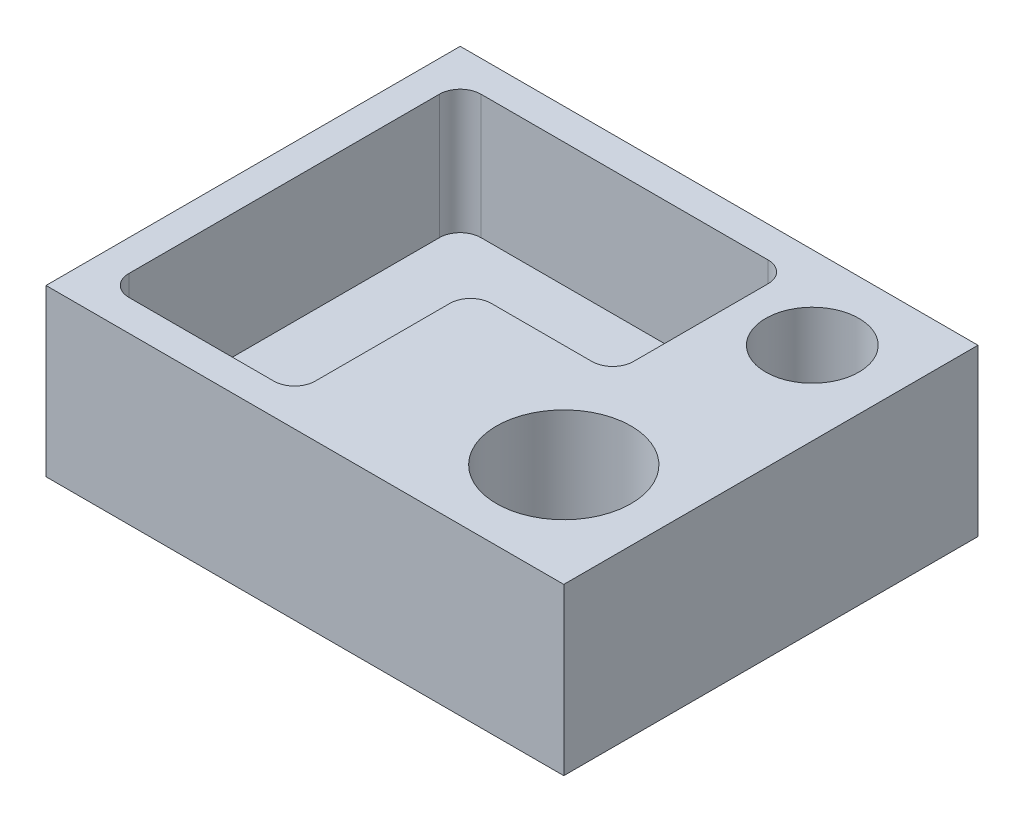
ISO-10303-21;
HEADER;
FILE_DESCRIPTION(('STEP AP214'),'2;1');
FILE_NAME('part.step','',(''),(''),'','','');
FILE_SCHEMA(('AUTOMOTIVE_DESIGN { 1 0 10303 214 1 1 1 1 }'));
ENDSEC;
DATA;
#1=APPLICATION_CONTEXT('core data for automotive mechanical design processes');
#2=APPLICATION_PROTOCOL_DEFINITION('international standard','automotive_design',2000,#1);
#3=PRODUCT_CONTEXT('',#1,'mechanical');
#4=PRODUCT('Part','Part','',(#3));
#5=PRODUCT_RELATED_PRODUCT_CATEGORY('part','',(#4));
#6=PRODUCT_DEFINITION_FORMATION('','',#4);
#7=PRODUCT_DEFINITION_CONTEXT('part definition',#1,'design');
#8=PRODUCT_DEFINITION('design','',#6,#7);
#9=PRODUCT_DEFINITION_SHAPE('','',#8);
#10=(LENGTH_UNIT() NAMED_UNIT(*) SI_UNIT(.MILLI.,.METRE.));
#11=(NAMED_UNIT(*) PLANE_ANGLE_UNIT() SI_UNIT($,.RADIAN.));
#12=(NAMED_UNIT(*) SI_UNIT($,.STERADIAN.) SOLID_ANGLE_UNIT());
#13=UNCERTAINTY_MEASURE_WITH_UNIT(LENGTH_MEASURE(1.E-05),#10,'distance_accuracy_value','');
#14=(GEOMETRIC_REPRESENTATION_CONTEXT(3) GLOBAL_UNCERTAINTY_ASSIGNED_CONTEXT((#13)) GLOBAL_UNIT_ASSIGNED_CONTEXT((#10,
#11,#12)) REPRESENTATION_CONTEXT('',''));
#15=CARTESIAN_POINT('',(0.,0.,0.));
#16=DIRECTION('',(0.,0.,1.));
#17=DIRECTION('',(1.,0.,0.));
#18=AXIS2_PLACEMENT_3D('',#15,#16,#17);
#19=CARTESIAN_POINT('',(-125.,80.,100.));
#20=DIRECTION('',(1.,0.,0.));
#21=DIRECTION('',(0.,0.,-1.));
#22=AXIS2_PLACEMENT_3D('',#19,#20,#21);
#23=PLANE('',#22);
#24=DIRECTION('',(0.,0.,1.));
#25=VECTOR('',#24,1.);
#26=CARTESIAN_POINT('',(-125.,0.,100.));
#27=LINE('',#26,#25);
#28=CARTESIAN_POINT('',(-125.,0.,-100.));
#29=VERTEX_POINT('',#28);
#30=CARTESIAN_POINT('',(-125.,0.,100.));
#31=VERTEX_POINT('',#30);
#32=EDGE_CURVE('E184',#29,#31,#27,.T.);
#33=ORIENTED_EDGE('',*,*,#32,.T.);
#34=DIRECTION('',(0.,-1.,0.));
#35=VECTOR('',#34,1.);
#36=CARTESIAN_POINT('',(-125.,80.,100.));
#37=LINE('',#36,#35);
#38=CARTESIAN_POINT('',(-125.,80.,100.));
#39=VERTEX_POINT('',#38);
#40=EDGE_CURVE('E165',#39,#31,#37,.T.);
#41=ORIENTED_EDGE('',*,*,#40,.F.);
#42=DIRECTION('',(0.,0.,1.));
#43=VECTOR('',#42,1.);
#44=CARTESIAN_POINT('',(-125.,80.,100.));
#45=LINE('',#44,#43);
#46=CARTESIAN_POINT('',(-125.,80.,-100.));
#47=VERTEX_POINT('',#46);
#48=EDGE_CURVE('E172',#47,#39,#45,.T.);
#49=ORIENTED_EDGE('',*,*,#48,.F.);
#50=DIRECTION('',(0.,-1.,0.));
#51=VECTOR('',#50,1.);
#52=CARTESIAN_POINT('',(-125.,80.,-100.));
#53=LINE('',#52,#51);
#54=EDGE_CURVE('E299',#47,#29,#53,.T.);
#55=ORIENTED_EDGE('',*,*,#54,.T.);
#56=EDGE_LOOP('',(#33,#41,#49,#55));
#57=FACE_BOUND('',#56,.T.);
#58=ADVANCED_FACE('F46',(#57),#23,.F.);
#59=CARTESIAN_POINT('',(125.,80.,100.));
#60=DIRECTION('',(0.,0.,-1.));
#61=DIRECTION('',(-1.,0.,0.));
#62=AXIS2_PLACEMENT_3D('',#59,#60,#61);
#63=PLANE('',#62);
#64=DIRECTION('',(1.,0.,0.));
#65=VECTOR('',#64,1.);
#66=CARTESIAN_POINT('',(125.,0.,100.));
#67=LINE('',#66,#65);
#68=CARTESIAN_POINT('',(125.,0.,100.));
#69=VERTEX_POINT('',#68);
#70=EDGE_CURVE('E301',#31,#69,#67,.T.);
#71=ORIENTED_EDGE('',*,*,#70,.T.);
#72=DIRECTION('',(0.,-1.,0.));
#73=VECTOR('',#72,1.);
#74=CARTESIAN_POINT('',(125.,80.,100.));
#75=LINE('',#74,#73);
#76=CARTESIAN_POINT('',(125.,80.,100.));
#77=VERTEX_POINT('',#76);
#78=EDGE_CURVE('E168',#77,#69,#75,.T.);
#79=ORIENTED_EDGE('',*,*,#78,.F.);
#80=DIRECTION('',(1.,0.,0.));
#81=VECTOR('',#80,1.);
#82=CARTESIAN_POINT('',(125.,80.,100.));
#83=LINE('',#82,#81);
#84=EDGE_CURVE('E161',#39,#77,#83,.T.);
#85=ORIENTED_EDGE('',*,*,#84,.F.);
#86=ORIENTED_EDGE('',*,*,#40,.T.);
#87=EDGE_LOOP('',(#71,#79,#85,#86));
#88=FACE_BOUND('',#87,.T.);
#89=ADVANCED_FACE('F163',(#88),#63,.F.);
#90=CARTESIAN_POINT('',(125.,80.,100.));
#91=DIRECTION('',(-1.,0.,0.));
#92=DIRECTION('',(0.,0.,1.));
#93=AXIS2_PLACEMENT_3D('',#90,#91,#92);
#94=PLANE('',#93);
#95=DIRECTION('',(0.,0.,-1.));
#96=VECTOR('',#95,1.);
#97=CARTESIAN_POINT('',(125.,0.,100.));
#98=LINE('',#97,#96);
#99=CARTESIAN_POINT('',(125.,0.,-100.));
#100=VERTEX_POINT('',#99);
#101=EDGE_CURVE('E303',#69,#100,#98,.T.);
#102=ORIENTED_EDGE('',*,*,#101,.T.);
#103=DIRECTION('',(0.,-1.,0.));
#104=VECTOR('',#103,1.);
#105=CARTESIAN_POINT('',(125.,80.,-100.));
#106=LINE('',#105,#104);
#107=CARTESIAN_POINT('',(125.,80.,-100.));
#108=VERTEX_POINT('',#107);
#109=EDGE_CURVE('E190',#108,#100,#106,.T.);
#110=ORIENTED_EDGE('',*,*,#109,.F.);
#111=DIRECTION('',(0.,0.,-1.));
#112=VECTOR('',#111,1.);
#113=CARTESIAN_POINT('',(125.,80.,100.));
#114=LINE('',#113,#112);
#115=EDGE_CURVE('E171',#77,#108,#114,.T.);
#116=ORIENTED_EDGE('',*,*,#115,.F.);
#117=ORIENTED_EDGE('',*,*,#78,.T.);
#118=EDGE_LOOP('',(#102,#110,#116,#117));
#119=FACE_BOUND('',#118,.T.);
#120=ADVANCED_FACE('F315',(#119),#94,.F.);
#121=CARTESIAN_POINT('',(125.,80.,-100.));
#122=DIRECTION('',(0.,0.,1.));
#123=DIRECTION('',(1.,0.,0.));
#124=AXIS2_PLACEMENT_3D('',#121,#122,#123);
#125=PLANE('',#124);
#126=DIRECTION('',(-1.,0.,0.));
#127=VECTOR('',#126,1.);
#128=CARTESIAN_POINT('',(125.,0.,-100.));
#129=LINE('',#128,#127);
#130=EDGE_CURVE('E181',#100,#29,#129,.T.);
#131=ORIENTED_EDGE('',*,*,#130,.T.);
#132=ORIENTED_EDGE('',*,*,#54,.F.);
#133=DIRECTION('',(-1.,0.,0.));
#134=VECTOR('',#133,1.);
#135=CARTESIAN_POINT('',(125.,80.,-100.));
#136=LINE('',#135,#134);
#137=EDGE_CURVE('E177',#108,#47,#136,.T.);
#138=ORIENTED_EDGE('',*,*,#137,.F.);
#139=ORIENTED_EDGE('',*,*,#109,.T.);
#140=EDGE_LOOP('',(#131,#132,#138,#139));
#141=FACE_BOUND('',#140,.T.);
#142=ADVANCED_FACE('F310',(#141),#125,.F.);
#143=CARTESIAN_POINT('',(0.,80.,0.));
#144=DIRECTION('',(0.,1.,0.));
#145=DIRECTION('',(0.,0.,1.));
#146=AXIS2_PLACEMENT_3D('',#143,#144,#145);
#147=PLANE('',#146);
#148=CARTESIAN_POINT('',(75.,80.,50.));
#149=DIRECTION('',(0.,1.,0.));
#150=DIRECTION('',(0.,0.,-1.));
#151=AXIS2_PLACEMENT_3D('',#148,#149,#150);
#152=CIRCLE('',#151,32.5);
#153=CARTESIAN_POINT('',(75.,80.,17.5));
#154=VERTEX_POINT('',#153);
#155=EDGE_CURVE('E594',#154,#154,#152,.T.);
#156=ORIENTED_EDGE('',*,*,#155,.F.);
#157=EDGE_LOOP('',(#156));
#158=FACE_BOUND('',#157,.T.);
#159=CARTESIAN_POINT('',(85.,80.,-60.));
#160=DIRECTION('',(0.,1.,0.));
#161=DIRECTION('',(0.,0.,1.));
#162=AXIS2_PLACEMENT_3D('',#159,#160,#161);
#163=CIRCLE('',#162,22.5);
#164=CARTESIAN_POINT('',(85.,80.,-37.5));
#165=VERTEX_POINT('',#164);
#166=EDGE_CURVE('E589',#165,#165,#163,.T.);
#167=ORIENTED_EDGE('',*,*,#166,.F.);
#168=EDGE_LOOP('',(#167));
#169=FACE_BOUND('',#168,.T.);
#170=DIRECTION('',(1.,0.,0.));
#171=VECTOR('',#170,1.);
#172=CARTESIAN_POINT('',(48.6206560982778,80.,0.));
#173=LINE('',#172,#171);
#174=CARTESIAN_POINT('',(-9.99999999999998,80.,0.));
#175=VERTEX_POINT('',#174);
#176=CARTESIAN_POINT('',(38.6206560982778,80.,0.));
#177=VERTEX_POINT('',#176);
#178=EDGE_CURVE('E289',#175,#177,#173,.T.);
#179=ORIENTED_EDGE('',*,*,#178,.F.);
#180=CARTESIAN_POINT('',(-9.99999999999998,80.,10.));
#181=DIRECTION('',(0.,1.,0.));
#182=DIRECTION('',(0.,0.,1.));
#183=AXIS2_PLACEMENT_3D('',#180,#181,#182);
#184=CIRCLE('',#183,10.);
#185=CARTESIAN_POINT('',(-20.,80.,10.));
#186=VERTEX_POINT('',#185);
#187=EDGE_CURVE('E196',#175,#186,#184,.T.);
#188=ORIENTED_EDGE('',*,*,#187,.T.);
#189=DIRECTION('',(0.,0.,-1.));
#190=VECTOR('',#189,1.);
#191=CARTESIAN_POINT('',(-20.,80.,0.));
#192=LINE('',#191,#190);
#193=CARTESIAN_POINT('',(-20.,80.,75.0000000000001));
#194=VERTEX_POINT('',#193);
#195=EDGE_CURVE('E286',#194,#186,#192,.T.);
#196=ORIENTED_EDGE('',*,*,#195,.F.);
#197=CARTESIAN_POINT('',(-30.,80.,75.0000000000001));
#198=DIRECTION('',(0.,1.,0.));
#199=DIRECTION('',(0.,0.,1.));
#200=AXIS2_PLACEMENT_3D('',#197,#198,#199);
#201=CIRCLE('',#200,10.);
#202=CARTESIAN_POINT('',(-30.,80.,85.));
#203=VERTEX_POINT('',#202);
#204=EDGE_CURVE('E239',#194,#203,#201,.F.);
#205=ORIENTED_EDGE('',*,*,#204,.T.);
#206=DIRECTION('',(1.,0.,0.));
#207=VECTOR('',#206,1.);
#208=CARTESIAN_POINT('',(-20.,80.,85.));
#209=LINE('',#208,#207);
#210=CARTESIAN_POINT('',(-100.,80.,85.));
#211=VERTEX_POINT('',#210);
#212=EDGE_CURVE('E247',#211,#203,#209,.T.);
#213=ORIENTED_EDGE('',*,*,#212,.F.);
#214=CARTESIAN_POINT('',(-100.,80.,75.0000000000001));
#215=DIRECTION('',(0.,1.,0.));
#216=DIRECTION('',(0.,0.,1.));
#217=AXIS2_PLACEMENT_3D('',#214,#215,#216);
#218=CIRCLE('',#217,10.);
#219=CARTESIAN_POINT('',(-110.,80.,75.0000000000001));
#220=VERTEX_POINT('',#219);
#221=EDGE_CURVE('E54',#211,#220,#218,.F.);
#222=ORIENTED_EDGE('',*,*,#221,.T.);
#223=DIRECTION('',(0.,0.,1.));
#224=VECTOR('',#223,1.);
#225=CARTESIAN_POINT('',(-110.,80.,-85.));
#226=LINE('',#225,#224);
#227=CARTESIAN_POINT('',(-110.,80.,-75.));
#228=VERTEX_POINT('',#227);
#229=EDGE_CURVE('E245',#228,#220,#226,.T.);
#230=ORIENTED_EDGE('',*,*,#229,.F.);
#231=CARTESIAN_POINT('',(-100.,80.,-75.));
#232=DIRECTION('',(0.,1.,0.));
#233=DIRECTION('',(0.,0.,1.));
#234=AXIS2_PLACEMENT_3D('',#231,#232,#233);
#235=CIRCLE('',#234,10.);
#236=CARTESIAN_POINT('',(-100.,80.,-85.));
#237=VERTEX_POINT('',#236);
#238=EDGE_CURVE('E11',#228,#237,#235,.F.);
#239=ORIENTED_EDGE('',*,*,#238,.T.);
#240=DIRECTION('',(-1.,0.,0.));
#241=VECTOR('',#240,1.);
#242=CARTESIAN_POINT('',(-20.,80.,-85.));
#243=LINE('',#242,#241);
#244=CARTESIAN_POINT('',(38.6206560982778,80.,-85.));
#245=VERTEX_POINT('',#244);
#246=EDGE_CURVE('E276',#245,#237,#243,.T.);
#247=ORIENTED_EDGE('',*,*,#246,.F.);
#248=CARTESIAN_POINT('',(38.6206560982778,80.,-75.));
#249=DIRECTION('',(0.,1.,0.));
#250=DIRECTION('',(0.,0.,1.));
#251=AXIS2_PLACEMENT_3D('',#248,#249,#250);
#252=CIRCLE('',#251,10.);
#253=CARTESIAN_POINT('',(48.6206560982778,80.,-75.));
#254=VERTEX_POINT('',#253);
#255=EDGE_CURVE('E237',#245,#254,#252,.F.);
#256=ORIENTED_EDGE('',*,*,#255,.T.);
#257=DIRECTION('',(0.,0.,-1.));
#258=VECTOR('',#257,1.);
#259=CARTESIAN_POINT('',(48.6206560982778,80.,-85.));
#260=LINE('',#259,#258);
#261=CARTESIAN_POINT('',(48.6206560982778,80.,-9.99999999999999));
#262=VERTEX_POINT('',#261);
#263=EDGE_CURVE('E292',#262,#254,#260,.T.);
#264=ORIENTED_EDGE('',*,*,#263,.F.);
#265=CARTESIAN_POINT('',(38.6206560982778,80.,-9.99999999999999));
#266=DIRECTION('',(0.,1.,0.));
#267=DIRECTION('',(0.,0.,1.));
#268=AXIS2_PLACEMENT_3D('',#265,#266,#267);
#269=CIRCLE('',#268,10.);
#270=EDGE_CURVE('E234',#262,#177,#269,.F.);
#271=ORIENTED_EDGE('',*,*,#270,.T.);
#272=EDGE_LOOP('',(#179,#188,#196,#205,#213,#222,#230,#239,#247,#256,#264,#271));
#273=FACE_BOUND('',#272,.T.);
#274=ORIENTED_EDGE('',*,*,#48,.T.);
#275=ORIENTED_EDGE('',*,*,#84,.T.);
#276=ORIENTED_EDGE('',*,*,#115,.T.);
#277=ORIENTED_EDGE('',*,*,#137,.T.);
#278=EDGE_LOOP('',(#274,#275,#276,#277));
#279=FACE_BOUND('',#278,.T.);
#280=ADVANCED_FACE('F175',(#158,#169,#273,#279),#147,.T.);
#281=CARTESIAN_POINT('',(0.,0.,0.));
#282=DIRECTION('',(0.,1.,0.));
#283=DIRECTION('',(0.,0.,1.));
#284=AXIS2_PLACEMENT_3D('',#281,#282,#283);
#285=PLANE('',#284);
#286=ORIENTED_EDGE('',*,*,#32,.F.);
#287=ORIENTED_EDGE('',*,*,#130,.F.);
#288=ORIENTED_EDGE('',*,*,#101,.F.);
#289=ORIENTED_EDGE('',*,*,#70,.F.);
#290=EDGE_LOOP('',(#286,#287,#288,#289));
#291=FACE_BOUND('',#290,.T.);
#292=ADVANCED_FACE('F314',(#291),#285,.F.);
#293=CARTESIAN_POINT('',(-110.,20.,-85.));
#294=DIRECTION('',(-1.,0.,0.));
#295=DIRECTION('',(0.,0.,1.));
#296=AXIS2_PLACEMENT_3D('',#293,#294,#295);
#297=PLANE('',#296);
#298=ORIENTED_EDGE('',*,*,#229,.T.);
#299=DIRECTION('',(0.,1.,0.));
#300=VECTOR('',#299,1.);
#301=CARTESIAN_POINT('',(-110.,20.,75.0000000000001));
#302=LINE('',#301,#300);
#303=CARTESIAN_POINT('',(-110.,20.,75.0000000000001));
#304=VERTEX_POINT('',#303);
#305=EDGE_CURVE('E230',#220,#304,#302,.F.);
#306=ORIENTED_EDGE('',*,*,#305,.T.);
#307=DIRECTION('',(0.,0.,1.));
#308=VECTOR('',#307,1.);
#309=CARTESIAN_POINT('',(-110.,20.,-85.));
#310=LINE('',#309,#308);
#311=CARTESIAN_POINT('',(-110.,20.,-75.));
#312=VERTEX_POINT('',#311);
#313=EDGE_CURVE('E267',#312,#304,#310,.T.);
#314=ORIENTED_EDGE('',*,*,#313,.F.);
#315=DIRECTION('',(0.,1.,0.));
#316=VECTOR('',#315,1.);
#317=CARTESIAN_POINT('',(-110.,80.,-75.));
#318=LINE('',#317,#316);
#319=EDGE_CURVE('E227',#312,#228,#318,.T.);
#320=ORIENTED_EDGE('',*,*,#319,.T.);
#321=EDGE_LOOP('',(#298,#306,#314,#320));
#322=FACE_BOUND('',#321,.T.);
#323=ADVANCED_FACE('F252',(#322),#297,.F.);
#324=CARTESIAN_POINT('',(-20.,20.,-85.));
#325=DIRECTION('',(0.,0.,-1.));
#326=DIRECTION('',(-1.,0.,0.));
#327=AXIS2_PLACEMENT_3D('',#324,#325,#326);
#328=PLANE('',#327);
#329=DIRECTION('',(-1.,0.,0.));
#330=VECTOR('',#329,1.);
#331=CARTESIAN_POINT('',(-20.,20.,-85.));
#332=LINE('',#331,#330);
#333=CARTESIAN_POINT('',(38.6206560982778,20.,-85.));
#334=VERTEX_POINT('',#333);
#335=CARTESIAN_POINT('',(-100.,20.,-85.));
#336=VERTEX_POINT('',#335);
#337=EDGE_CURVE('E283',#334,#336,#332,.T.);
#338=ORIENTED_EDGE('',*,*,#337,.F.);
#339=DIRECTION('',(0.,1.,0.));
#340=VECTOR('',#339,1.);
#341=CARTESIAN_POINT('',(38.6206560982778,80.,-85.));
#342=LINE('',#341,#340);
#343=EDGE_CURVE('E219',#334,#245,#342,.T.);
#344=ORIENTED_EDGE('',*,*,#343,.T.);
#345=ORIENTED_EDGE('',*,*,#246,.T.);
#346=DIRECTION('',(0.,1.,0.));
#347=VECTOR('',#346,1.);
#348=CARTESIAN_POINT('',(-100.,20.,-85.));
#349=LINE('',#348,#347);
#350=EDGE_CURVE('E61',#237,#336,#349,.F.);
#351=ORIENTED_EDGE('',*,*,#350,.T.);
#352=EDGE_LOOP('',(#338,#344,#345,#351));
#353=FACE_BOUND('',#352,.T.);
#354=ADVANCED_FACE('F354',(#353),#328,.F.);
#355=CARTESIAN_POINT('',(48.6206560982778,20.,-85.));
#356=DIRECTION('',(1.,0.,0.));
#357=DIRECTION('',(0.,0.,-1.));
#358=AXIS2_PLACEMENT_3D('',#355,#356,#357);
#359=PLANE('',#358);
#360=DIRECTION('',(0.,0.,-1.));
#361=VECTOR('',#360,1.);
#362=CARTESIAN_POINT('',(48.6206560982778,20.,-85.));
#363=LINE('',#362,#361);
#364=CARTESIAN_POINT('',(48.6206560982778,20.,-9.99999999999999));
#365=VERTEX_POINT('',#364);
#366=CARTESIAN_POINT('',(48.6206560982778,20.,-75.));
#367=VERTEX_POINT('',#366);
#368=EDGE_CURVE('E281',#365,#367,#363,.T.);
#369=ORIENTED_EDGE('',*,*,#368,.F.);
#370=DIRECTION('',(0.,1.,0.));
#371=VECTOR('',#370,1.);
#372=CARTESIAN_POINT('',(48.6206560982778,80.,-9.99999999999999));
#373=LINE('',#372,#371);
#374=EDGE_CURVE('E205',#365,#262,#373,.T.);
#375=ORIENTED_EDGE('',*,*,#374,.T.);
#376=ORIENTED_EDGE('',*,*,#263,.T.);
#377=DIRECTION('',(0.,1.,0.));
#378=VECTOR('',#377,1.);
#379=CARTESIAN_POINT('',(48.6206560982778,20.,-75.));
#380=LINE('',#379,#378);
#381=EDGE_CURVE('E203',#254,#367,#380,.F.);
#382=ORIENTED_EDGE('',*,*,#381,.T.);
#383=EDGE_LOOP('',(#369,#375,#376,#382));
#384=FACE_BOUND('',#383,.T.);
#385=ADVANCED_FACE('F360',(#384),#359,.F.);
#386=CARTESIAN_POINT('',(48.6206560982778,20.,0.));
#387=DIRECTION('',(0.,0.,1.));
#388=DIRECTION('',(1.,0.,0.));
#389=AXIS2_PLACEMENT_3D('',#386,#387,#388);
#390=PLANE('',#389);
#391=DIRECTION('',(1.,0.,0.));
#392=VECTOR('',#391,1.);
#393=CARTESIAN_POINT('',(48.6206560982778,20.,0.));
#394=LINE('',#393,#392);
#395=CARTESIAN_POINT('',(-9.99999999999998,20.,0.));
#396=VERTEX_POINT('',#395);
#397=CARTESIAN_POINT('',(38.6206560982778,20.,0.));
#398=VERTEX_POINT('',#397);
#399=EDGE_CURVE('E274',#396,#398,#394,.T.);
#400=ORIENTED_EDGE('',*,*,#399,.F.);
#401=DIRECTION('',(0.,1.,0.));
#402=VECTOR('',#401,1.);
#403=CARTESIAN_POINT('',(-9.99999999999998,20.,0.));
#404=LINE('',#403,#402);
#405=EDGE_CURVE('E188',#396,#175,#404,.T.);
#406=ORIENTED_EDGE('',*,*,#405,.T.);
#407=ORIENTED_EDGE('',*,*,#178,.T.);
#408=DIRECTION('',(0.,1.,0.));
#409=VECTOR('',#408,1.);
#410=CARTESIAN_POINT('',(38.6206560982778,20.,0.));
#411=LINE('',#410,#409);
#412=EDGE_CURVE('E185',#177,#398,#411,.F.);
#413=ORIENTED_EDGE('',*,*,#412,.T.);
#414=EDGE_LOOP('',(#400,#406,#407,#413));
#415=FACE_BOUND('',#414,.T.);
#416=ADVANCED_FACE('F366',(#415),#390,.F.);
#417=CARTESIAN_POINT('',(-20.,20.,0.));
#418=DIRECTION('',(1.,0.,0.));
#419=DIRECTION('',(0.,0.,-1.));
#420=AXIS2_PLACEMENT_3D('',#417,#418,#419);
#421=PLANE('',#420);
#422=ORIENTED_EDGE('',*,*,#195,.T.);
#423=DIRECTION('',(0.,1.,0.));
#424=VECTOR('',#423,1.);
#425=CARTESIAN_POINT('',(-20.,20.,10.));
#426=LINE('',#425,#424);
#427=CARTESIAN_POINT('',(-20.,20.,10.));
#428=VERTEX_POINT('',#427);
#429=EDGE_CURVE('E201',#186,#428,#426,.F.);
#430=ORIENTED_EDGE('',*,*,#429,.T.);
#431=DIRECTION('',(0.,0.,-1.));
#432=VECTOR('',#431,1.);
#433=CARTESIAN_POINT('',(-20.,20.,0.));
#434=LINE('',#433,#432);
#435=CARTESIAN_POINT('',(-20.,20.,75.0000000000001));
#436=VERTEX_POINT('',#435);
#437=EDGE_CURVE('E271',#436,#428,#434,.T.);
#438=ORIENTED_EDGE('',*,*,#437,.F.);
#439=DIRECTION('',(0.,1.,0.));
#440=VECTOR('',#439,1.);
#441=CARTESIAN_POINT('',(-20.,80.,75.0000000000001));
#442=LINE('',#441,#440);
#443=EDGE_CURVE('E198',#436,#194,#442,.T.);
#444=ORIENTED_EDGE('',*,*,#443,.T.);
#445=EDGE_LOOP('',(#422,#430,#438,#444));
#446=FACE_BOUND('',#445,.T.);
#447=ADVANCED_FACE('F372',(#446),#421,.F.);
#448=CARTESIAN_POINT('',(-20.,20.,85.));
#449=DIRECTION('',(0.,0.,1.));
#450=DIRECTION('',(1.,0.,0.));
#451=AXIS2_PLACEMENT_3D('',#448,#449,#450);
#452=PLANE('',#451);
#453=ORIENTED_EDGE('',*,*,#212,.T.);
#454=DIRECTION('',(0.,1.,0.));
#455=VECTOR('',#454,1.);
#456=CARTESIAN_POINT('',(-30.,20.,85.));
#457=LINE('',#456,#455);
#458=CARTESIAN_POINT('',(-30.,20.,85.));
#459=VERTEX_POINT('',#458);
#460=EDGE_CURVE('E225',#203,#459,#457,.F.);
#461=ORIENTED_EDGE('',*,*,#460,.T.);
#462=DIRECTION('',(1.,0.,0.));
#463=VECTOR('',#462,1.);
#464=CARTESIAN_POINT('',(-20.,20.,85.));
#465=LINE('',#464,#463);
#466=CARTESIAN_POINT('',(-100.,20.,85.));
#467=VERTEX_POINT('',#466);
#468=EDGE_CURVE('E265',#467,#459,#465,.T.);
#469=ORIENTED_EDGE('',*,*,#468,.F.);
#470=DIRECTION('',(0.,1.,0.));
#471=VECTOR('',#470,1.);
#472=CARTESIAN_POINT('',(-100.,80.,85.));
#473=LINE('',#472,#471);
#474=EDGE_CURVE('E222',#467,#211,#473,.T.);
#475=ORIENTED_EDGE('',*,*,#474,.T.);
#476=EDGE_LOOP('',(#453,#461,#469,#475));
#477=FACE_BOUND('',#476,.T.);
#478=ADVANCED_FACE('F269',(#477),#452,.F.);
#479=CARTESIAN_POINT('',(0.,20.,0.));
#480=DIRECTION('',(0.,-1.,0.));
#481=DIRECTION('',(0.,0.,-1.));
#482=AXIS2_PLACEMENT_3D('',#479,#480,#481);
#483=PLANE('',#482);
#484=ORIENTED_EDGE('',*,*,#399,.T.);
#485=CARTESIAN_POINT('',(38.6206560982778,20.,-9.99999999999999));
#486=DIRECTION('',(0.,-1.,0.));
#487=DIRECTION('',(0.,0.,-1.));
#488=AXIS2_PLACEMENT_3D('',#485,#486,#487);
#489=CIRCLE('',#488,10.);
#490=EDGE_CURVE('E216',#398,#365,#489,.F.);
#491=ORIENTED_EDGE('',*,*,#490,.T.);
#492=ORIENTED_EDGE('',*,*,#368,.T.);
#493=CARTESIAN_POINT('',(38.6206560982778,20.,-75.));
#494=DIRECTION('',(0.,-1.,0.));
#495=DIRECTION('',(0.,0.,-1.));
#496=AXIS2_PLACEMENT_3D('',#493,#494,#495);
#497=CIRCLE('',#496,10.);
#498=EDGE_CURVE('E68',#367,#334,#497,.F.);
#499=ORIENTED_EDGE('',*,*,#498,.T.);
#500=ORIENTED_EDGE('',*,*,#337,.T.);
#501=CARTESIAN_POINT('',(-100.,20.,-75.));
#502=DIRECTION('',(0.,-1.,0.));
#503=DIRECTION('',(0.,0.,-1.));
#504=AXIS2_PLACEMENT_3D('',#501,#502,#503);
#505=CIRCLE('',#504,10.);
#506=EDGE_CURVE('E209',#336,#312,#505,.F.);
#507=ORIENTED_EDGE('',*,*,#506,.T.);
#508=ORIENTED_EDGE('',*,*,#313,.T.);
#509=CARTESIAN_POINT('',(-100.,20.,75.0000000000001));
#510=DIRECTION('',(0.,-1.,0.));
#511=DIRECTION('',(0.,0.,-1.));
#512=AXIS2_PLACEMENT_3D('',#509,#510,#511);
#513=CIRCLE('',#512,10.);
#514=EDGE_CURVE('E211',#304,#467,#513,.F.);
#515=ORIENTED_EDGE('',*,*,#514,.T.);
#516=ORIENTED_EDGE('',*,*,#468,.T.);
#517=CARTESIAN_POINT('',(-30.,20.,75.0000000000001));
#518=DIRECTION('',(0.,-1.,0.));
#519=DIRECTION('',(0.,0.,-1.));
#520=AXIS2_PLACEMENT_3D('',#517,#518,#519);
#521=CIRCLE('',#520,10.);
#522=EDGE_CURVE('E213',#459,#436,#521,.F.);
#523=ORIENTED_EDGE('',*,*,#522,.T.);
#524=ORIENTED_EDGE('',*,*,#437,.T.);
#525=CARTESIAN_POINT('',(-9.99999999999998,20.,10.));
#526=DIRECTION('',(0.,-1.,0.));
#527=DIRECTION('',(0.,0.,-1.));
#528=AXIS2_PLACEMENT_3D('',#525,#526,#527);
#529=CIRCLE('',#528,10.);
#530=EDGE_CURVE('E232',#428,#396,#529,.T.);
#531=ORIENTED_EDGE('',*,*,#530,.T.);
#532=EDGE_LOOP('',(#484,#491,#492,#499,#500,#507,#508,#515,#516,#523,#524,#531));
#533=FACE_BOUND('',#532,.T.);
#534=ADVANCED_FACE('F264',(#533),#483,.F.);
#535=CARTESIAN_POINT('',(85.,20.,-60.));
#536=DIRECTION('',(0.,1.,0.));
#537=DIRECTION('',(0.,0.,1.));
#538=AXIS2_PLACEMENT_3D('',#535,#536,#537);
#539=CYLINDRICAL_SURFACE('',#538,22.5);
#540=CARTESIAN_POINT('',(85.,20.,-60.));
#541=DIRECTION('',(0.,1.,0.));
#542=DIRECTION('',(0.,0.,1.));
#543=AXIS2_PLACEMENT_3D('',#540,#541,#542);
#544=CIRCLE('',#543,22.5);
#545=CARTESIAN_POINT('',(85.,20.,-37.5));
#546=VERTEX_POINT('',#545);
#547=EDGE_CURVE('E256',#546,#546,#544,.T.);
#548=ORIENTED_EDGE('',*,*,#547,.F.);
#549=EDGE_LOOP('',(#548));
#550=FACE_BOUND('',#549,.T.);
#551=ORIENTED_EDGE('',*,*,#166,.T.);
#552=EDGE_LOOP('',(#551));
#553=FACE_BOUND('',#552,.T.);
#554=ADVANCED_FACE('F464',(#550,#553),#539,.F.);
#555=CARTESIAN_POINT('',(85.,20.,-60.));
#556=DIRECTION('',(0.,1.,0.));
#557=DIRECTION('',(0.,0.,1.));
#558=AXIS2_PLACEMENT_3D('',#555,#556,#557);
#559=PLANE('',#558);
#560=ORIENTED_EDGE('',*,*,#547,.T.);
#561=EDGE_LOOP('',(#560));
#562=FACE_BOUND('',#561,.T.);
#563=ADVANCED_FACE('F458',(#562),#559,.T.);
#564=CARTESIAN_POINT('',(75.,20.,50.));
#565=DIRECTION('',(0.,1.,0.));
#566=DIRECTION('',(0.,0.,1.));
#567=AXIS2_PLACEMENT_3D('',#564,#565,#566);
#568=CYLINDRICAL_SURFACE('',#567,32.5);
#569=CARTESIAN_POINT('',(75.,20.,50.));
#570=DIRECTION('',(0.,1.,0.));
#571=DIRECTION('',(0.,0.,-1.));
#572=AXIS2_PLACEMENT_3D('',#569,#570,#571);
#573=CIRCLE('',#572,32.5);
#574=CARTESIAN_POINT('',(75.,20.,17.5));
#575=VERTEX_POINT('',#574);
#576=EDGE_CURVE('E591',#575,#575,#573,.T.);
#577=ORIENTED_EDGE('',*,*,#576,.F.);
#578=EDGE_LOOP('',(#577));
#579=FACE_BOUND('',#578,.T.);
#580=ORIENTED_EDGE('',*,*,#155,.T.);
#581=EDGE_LOOP('',(#580));
#582=FACE_BOUND('',#581,.T.);
#583=ADVANCED_FACE('F448',(#579,#582),#568,.F.);
#584=CARTESIAN_POINT('',(75.,20.,50.));
#585=DIRECTION('',(0.,-1.,0.));
#586=DIRECTION('',(0.,0.,-1.));
#587=AXIS2_PLACEMENT_3D('',#584,#585,#586);
#588=PLANE('',#587);
#589=ORIENTED_EDGE('',*,*,#576,.T.);
#590=EDGE_LOOP('',(#589));
#591=FACE_BOUND('',#590,.T.);
#592=ADVANCED_FACE('F333',(#591),#588,.F.);
#593=CARTESIAN_POINT('',(-9.99999999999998,20.,10.));
#594=DIRECTION('',(0.,1.,0.));
#595=DIRECTION('',(0.,0.,1.));
#596=AXIS2_PLACEMENT_3D('',#593,#594,#595);
#597=CYLINDRICAL_SURFACE('',#596,10.);
#598=ORIENTED_EDGE('',*,*,#530,.F.);
#599=ORIENTED_EDGE('',*,*,#429,.F.);
#600=ORIENTED_EDGE('',*,*,#187,.F.);
#601=ORIENTED_EDGE('',*,*,#405,.F.);
#602=EDGE_LOOP('',(#598,#599,#600,#601));
#603=FACE_BOUND('',#602,.T.);
#604=ADVANCED_FACE('F329',(#603),#597,.T.);
#605=CARTESIAN_POINT('',(38.6206560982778,20.,-9.99999999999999));
#606=DIRECTION('',(0.,-1.,0.));
#607=DIRECTION('',(0.,0.,-1.));
#608=AXIS2_PLACEMENT_3D('',#605,#606,#607);
#609=CYLINDRICAL_SURFACE('',#608,10.);
#610=ORIENTED_EDGE('',*,*,#490,.F.);
#611=ORIENTED_EDGE('',*,*,#412,.F.);
#612=ORIENTED_EDGE('',*,*,#270,.F.);
#613=ORIENTED_EDGE('',*,*,#374,.F.);
#614=EDGE_LOOP('',(#610,#611,#612,#613));
#615=FACE_BOUND('',#614,.T.);
#616=ADVANCED_FACE('F332',(#615),#609,.F.);
#617=CARTESIAN_POINT('',(38.6206560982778,20.,-75.));
#618=DIRECTION('',(0.,-1.,0.));
#619=DIRECTION('',(0.,0.,-1.));
#620=AXIS2_PLACEMENT_3D('',#617,#618,#619);
#621=CYLINDRICAL_SURFACE('',#620,10.);
#622=ORIENTED_EDGE('',*,*,#498,.F.);
#623=ORIENTED_EDGE('',*,*,#381,.F.);
#624=ORIENTED_EDGE('',*,*,#255,.F.);
#625=ORIENTED_EDGE('',*,*,#343,.F.);
#626=EDGE_LOOP('',(#622,#623,#624,#625));
#627=FACE_BOUND('',#626,.T.);
#628=ADVANCED_FACE('F337',(#627),#621,.F.);
#629=CARTESIAN_POINT('',(-30.,20.,75.0000000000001));
#630=DIRECTION('',(0.,-1.,0.));
#631=DIRECTION('',(0.,0.,-1.));
#632=AXIS2_PLACEMENT_3D('',#629,#630,#631);
#633=CYLINDRICAL_SURFACE('',#632,10.);
#634=ORIENTED_EDGE('',*,*,#522,.F.);
#635=ORIENTED_EDGE('',*,*,#460,.F.);
#636=ORIENTED_EDGE('',*,*,#204,.F.);
#637=ORIENTED_EDGE('',*,*,#443,.F.);
#638=EDGE_LOOP('',(#634,#635,#636,#637));
#639=FACE_BOUND('',#638,.T.);
#640=ADVANCED_FACE('F341',(#639),#633,.F.);
#641=CARTESIAN_POINT('',(-100.,20.,75.0000000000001));
#642=DIRECTION('',(0.,-1.,0.));
#643=DIRECTION('',(0.,0.,-1.));
#644=AXIS2_PLACEMENT_3D('',#641,#642,#643);
#645=CYLINDRICAL_SURFACE('',#644,10.);
#646=ORIENTED_EDGE('',*,*,#514,.F.);
#647=ORIENTED_EDGE('',*,*,#305,.F.);
#648=ORIENTED_EDGE('',*,*,#221,.F.);
#649=ORIENTED_EDGE('',*,*,#474,.F.);
#650=EDGE_LOOP('',(#646,#647,#648,#649));
#651=FACE_BOUND('',#650,.T.);
#652=ADVANCED_FACE('F259',(#651),#645,.F.);
#653=CARTESIAN_POINT('',(-100.,20.,-75.));
#654=DIRECTION('',(0.,-1.,0.));
#655=DIRECTION('',(0.,0.,-1.));
#656=AXIS2_PLACEMENT_3D('',#653,#654,#655);
#657=CYLINDRICAL_SURFACE('',#656,10.);
#658=ORIENTED_EDGE('',*,*,#506,.F.);
#659=ORIENTED_EDGE('',*,*,#350,.F.);
#660=ORIENTED_EDGE('',*,*,#238,.F.);
#661=ORIENTED_EDGE('',*,*,#319,.F.);
#662=EDGE_LOOP('',(#658,#659,#660,#661));
#663=FACE_BOUND('',#662,.T.);
#664=ADVANCED_FACE('F48',(#663),#657,.F.);
#665=CLOSED_SHELL('',(#58,#89,#120,#142,#280,#292,#323,#354,#385,#416,#447,#478,#534,#554,#563,
#583,#592,#604,#616,#628,#640,#652,#664));
#666=MANIFOLD_SOLID_BREP('B2',#665);
#667=ADVANCED_BREP_SHAPE_REPRESENTATION('',(#18,#666),#14);
#668=SHAPE_DEFINITION_REPRESENTATION(#9,#667);
ENDSEC;
END-ISO-10303-21;
